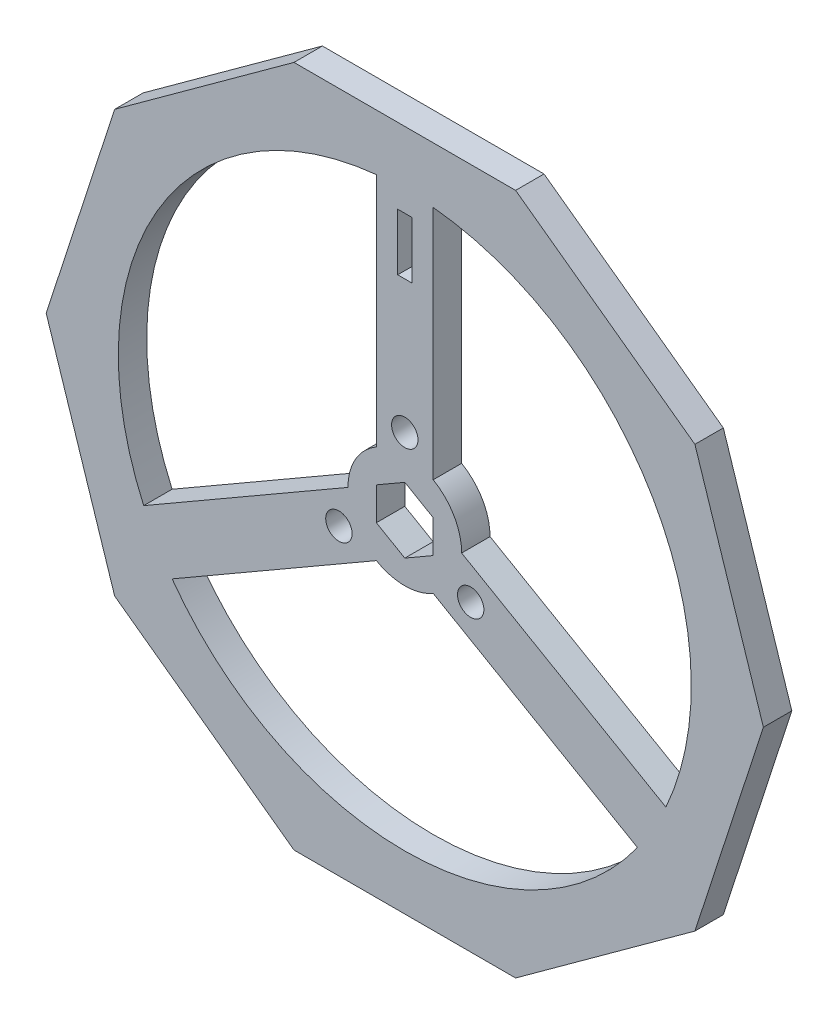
from build123d import *

# Parameters (mm, degrees)
SKETCH1_W             = 1.5875
SKETCH1_H             = 6.35
BOSS_EXTRUDE1_DEPTH   = 3.175
F_4_CLEARANCE_HOLE1_D = 2.9464


with BuildPart() as part:
    # Sketch1 → Boss-Extrude1 (new body)
    with BuildSketch(Plane.XY):
        Polygon((32.409795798, 23.547094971), (12.379440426, 38.1), (-12.379440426, 38.1), (-32.409795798, 23.547094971), (-40.060710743, 0), (-32.409795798, -23.547094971), (-12.379440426, -38.1), (12.379440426, -38.1), (32.409795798, -23.547094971), (40.060710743, 0), align=None)
        Polygon((3.175, -1.833087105), (3.175, 1.833087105), (0, 3.666174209), (-3.175, 1.833087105), (-3.175, -1.833087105), (0, -3.666174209), align=None, mode=Mode.SUBTRACT)
        with BuildLine():
            Line((3.175, 31.846120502), (3.175, 5.499261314))
            ThreePointArc((3.175, 5.499261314), (5.499261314, 3.175), (6.35, 0))
            Line((6.35, 0), (29.167049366, -13.173429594))
            ThreePointArc((29.167049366, -13.173429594), (27.716277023, 16.002), (3.175, 31.846120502))
        make_face(mode=Mode.SUBTRACT)
        with BuildLine():
            Line((-3.175, 31.846120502), (-3.175, 5.499261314))
            ThreePointArc((-3.175, 5.499261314), (-5.499261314, 3.175), (-6.35, 0))
            Line((-6.35, 0), (-29.167049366, -13.173429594))
            ThreePointArc((-29.167049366, -13.173429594), (-27.716277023, 16.002), (-3.175, 31.846120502))
        make_face(mode=Mode.SUBTRACT)
        with BuildLine():
            Line((25.992049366, -18.672690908), (3.175, -5.499261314))
            ThreePointArc((3.175, -5.499261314), (0, -6.35), (-3.175, -5.499261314))
            Line((-3.175, -5.499261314), (-25.992049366, -18.672690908))
            ThreePointArc((-25.992049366, -18.672690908), (0, -32.004), (25.992049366, -18.672690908))
        make_face(mode=Mode.SUBTRACT)
        with Locations((0, 26.519544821)):
            Rectangle(SKETCH1_W, SKETCH1_H, mode=Mode.SUBTRACT)
    extrude(amount=BOSS_EXTRUDE1_DEPTH)

    # 4 Clearance Hole1 (through all)
    with Locations(Plane.XY.offset(3.175)):
        with Locations((0, 8.5), (7.361215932, -4.25), (-7.361215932, -4.25)):
            Hole(F_4_CLEARANCE_HOLE1_D / 2)


solid = part.part
